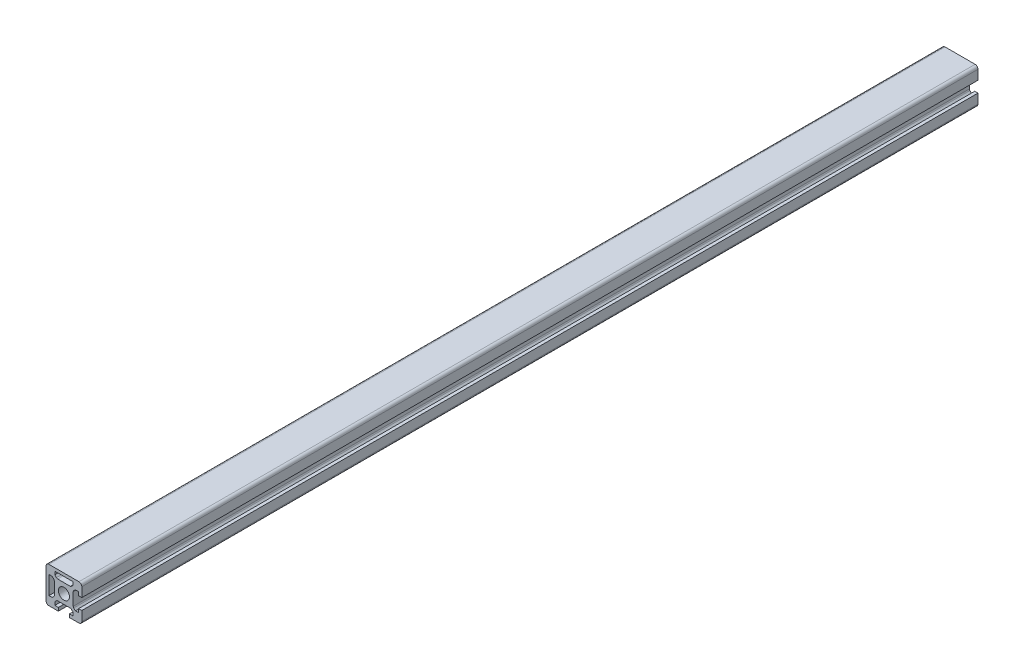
from build123d import *

# Parameters (mm, degrees)
ESQUISSE1_R        = 3.1
BOSS_EXTRU_1_DEPTH = 500


with BuildPart() as part:
    # Esquisse1 → Boss.-Extru.1 (new body)
    with BuildSketch(Plane.XY.offset(1)):
        with BuildLine():
            Line((-10, 8.4), (-10, -8.4))
            ThreePointArc((-10, -8.4), (-9.53137085, -9.53137085), (-8.4, -10))
            Line((-8.4, -10), (-3.1, -10))
            Line((-3.1, -10), (-3.1, -8.2))
            Line((-3.1, -8.2), (-5.1, -8.2))
            Line((-5.1, -8.2), (-5.1, -6.4))
            Line((-5.1, -6.4), (-4.192893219, -5.492893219))
            ThreePointArc((-4.192893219, -5.492893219), (-3.86846987, -5.276120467), (-3.485786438, -5.2))
            Line((-3.485786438, -5.2), (3.485786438, -5.2))
            ThreePointArc((3.485786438, -5.2), (3.86846987, -5.276120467), (4.192893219, -5.492893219))
            Line((4.192893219, -5.492893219), (5.1, -6.4))
            Line((5.1, -6.4), (5.1, -8.2))
            Line((5.1, -8.2), (3.1, -8.2))
            Line((3.1, -8.2), (3.1, -10))
            Line((3.1, -10), (8.4, -10))
            ThreePointArc((8.4, -10), (9.53137085, -9.53137085), (10, -8.4))
            Line((10, -8.4), (10, -3.1))
            Line((10, -3.1), (8.2, -3.1))
            Line((8.2, -3.1), (8.2, -5.1))
            Line((8.2, -5.1), (6.4, -5.1))
            Line((6.4, -5.1), (5.492893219, -4.192893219))
            ThreePointArc((5.492893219, -4.192893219), (5.276120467, -3.86846987), (5.2, -3.485786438))
            Line((5.2, -3.485786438), (5.2, 3.485786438))
            ThreePointArc((5.2, 3.485786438), (5.276120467, 3.86846987), (5.492893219, 4.192893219))
            Line((5.492893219, 4.192893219), (6.4, 5.1))
            Line((6.4, 5.1), (8.2, 5.1))
            Line((8.2, 5.1), (8.2, 3.1))
            Line((8.2, 3.1), (10, 3.1))
            Line((10, 3.1), (10, 8.4))
            ThreePointArc((10, 8.4), (9.53137085, 9.53137085), (8.4, 10))
            Line((8.4, 10), (-8.4, 10))
            ThreePointArc((-8.4, 10), (-9.53137085, 9.53137085), (-10, 8.4))
        make_face()
        with Locations(Location((0, 0, 0), (0, 0, 180))):
            Circle(ESQUISSE1_R, mode=Mode.SUBTRACT)
        with BuildLine():
            Line((3.485786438, 5.35), (-3.485786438, 5.35))
            ThreePointArc((-3.485786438, 5.35), (-3.86846987, 5.426120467), (-4.192893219, 5.642893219))
            Line((-4.192893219, 5.642893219), (-5.1, 6.55))
            Line((-5.1, 6.55), (-5.1, 8.35))
            Line((-5.1, 8.35), (5.1, 8.35))
            Line((5.1, 8.35), (5.1, 6.55))
            Line((5.1, 6.55), (4.192893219, 5.642893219))
            ThreePointArc((4.192893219, 5.642893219), (3.86846987, 5.426120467), (3.485786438, 5.35))
        make_face(mode=Mode.SUBTRACT)
        with BuildLine():
            Line((-5.35, 3.485786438), (-5.35, -3.485786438))
            ThreePointArc((-5.35, -3.485786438), (-5.426120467, -3.86846987), (-5.642893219, -4.192893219))
            Line((-5.642893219, -4.192893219), (-6.55, -5.1))
            Line((-6.55, -5.1), (-8.35, -5.1))
            Line((-8.35, -5.1), (-8.35, 5.1))
            Line((-8.35, 5.1), (-6.55, 5.1))
            Line((-6.55, 5.1), (-5.642893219, 4.192893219))
            ThreePointArc((-5.642893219, 4.192893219), (-5.426120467, 3.86846987), (-5.35, 3.485786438))
        make_face(mode=Mode.SUBTRACT)
    extrude(amount=-BOSS_EXTRU_1_DEPTH)


solid = part.part
